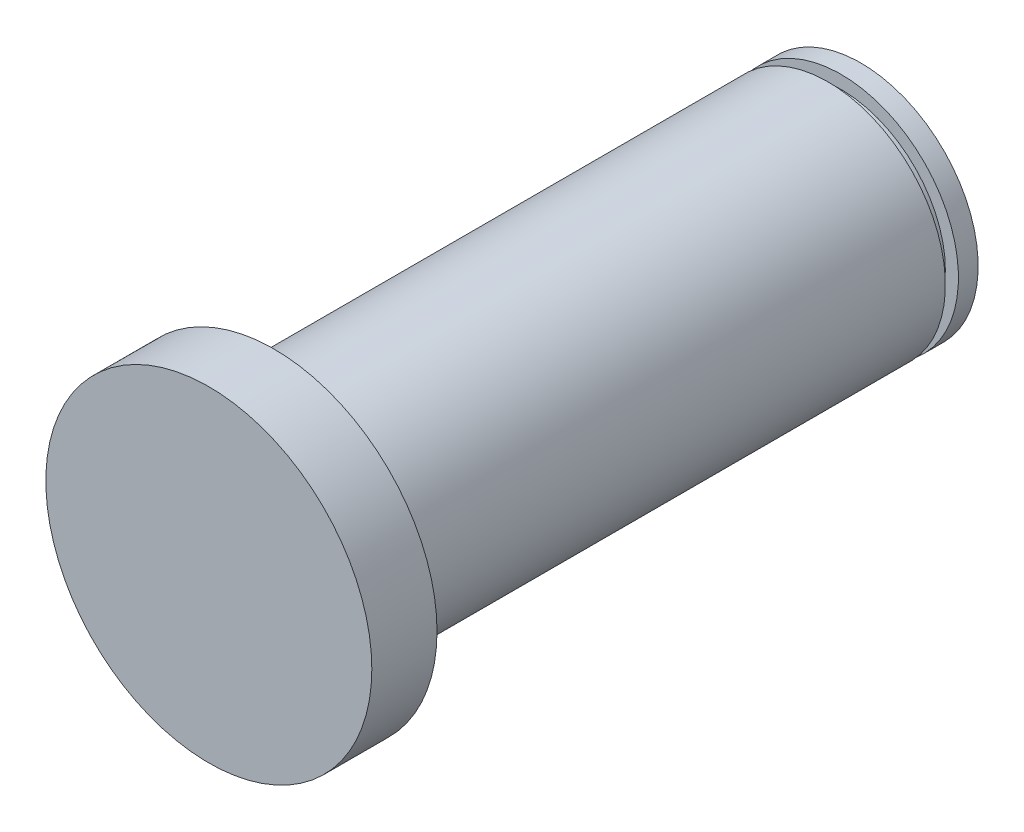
from build123d import *

# Parameters (mm, degrees)
ESQUISSE1_R        = 9
BOSS_EXTRU_1_DEPTH = 45
ESQUISSE2_R        = 12.5
BOSS_EXTRU_2_DEPTH = 5
ESQUISSE3_W        = 1
ESQUISSE3_H        = 1


with BuildPart() as part:
    # Esquisse1 → Boss.-Extru.1 (new body)
    with BuildSketch(Plane.XY):
        with Locations(Location((0, 0, 0), (0, 0, 180))):
            Circle(ESQUISSE1_R)
    extrude(amount=BOSS_EXTRU_1_DEPTH)

    # Esquisse2 → Boss.-Extru.2 (add)
    with BuildSketch(Plane.XY.offset(45)):
        Circle(ESQUISSE2_R)
    extrude(amount=BOSS_EXTRU_2_DEPTH)

    # Esquisse3 → Enl_vement de mati_re-R_volution1 (revolve, cut)
    with BuildSketch(Plane(origin=(0, 0, 0), x_dir=(0, 0, -1), z_dir=(1, 0, 0)), mode=Mode.PRIVATE) as enl_vement_de_mati_re_r_volution1_sk:
        with Locations((-2.013787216, 8.5)):
            Rectangle(ESQUISSE3_W, ESQUISSE3_H)
    revolve(enl_vement_de_mati_re_r_volution1_sk.sketch.rotate(Axis((0, 0, 45), (0, 0, -1)), 270), axis=Axis((0, 0, 45), (0, 0, -1)), mode=Mode.SUBTRACT)


solid = part.part
